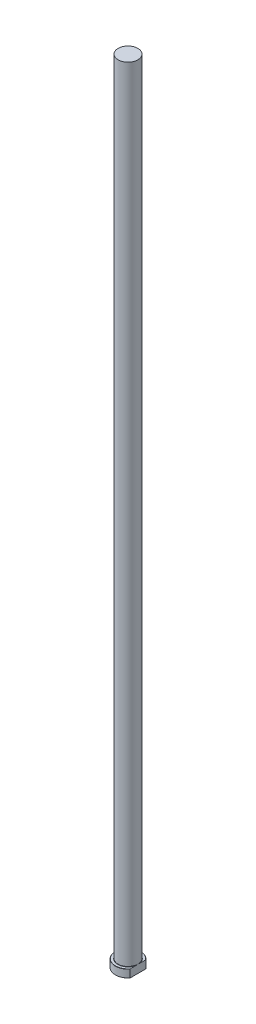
ISO-10303-21;
HEADER;
FILE_DESCRIPTION(('STEP AP214'),'2;1');
FILE_NAME('part.step','',(''),(''),'','','');
FILE_SCHEMA(('AUTOMOTIVE_DESIGN { 1 0 10303 214 1 1 1 1 }'));
ENDSEC;
DATA;
#1=APPLICATION_CONTEXT('core data for automotive mechanical design processes');
#2=APPLICATION_PROTOCOL_DEFINITION('international standard','automotive_design',2000,#1);
#3=PRODUCT_CONTEXT('',#1,'mechanical');
#4=PRODUCT('Part','Part','',(#3));
#5=PRODUCT_RELATED_PRODUCT_CATEGORY('part','',(#4));
#6=PRODUCT_DEFINITION_FORMATION('','',#4);
#7=PRODUCT_DEFINITION_CONTEXT('part definition',#1,'design');
#8=PRODUCT_DEFINITION('design','',#6,#7);
#9=PRODUCT_DEFINITION_SHAPE('','',#8);
#10=(LENGTH_UNIT() NAMED_UNIT(*) SI_UNIT(.MILLI.,.METRE.));
#11=(NAMED_UNIT(*) PLANE_ANGLE_UNIT() SI_UNIT($,.RADIAN.));
#12=(NAMED_UNIT(*) SI_UNIT($,.STERADIAN.) SOLID_ANGLE_UNIT());
#13=UNCERTAINTY_MEASURE_WITH_UNIT(LENGTH_MEASURE(1.E-05),#10,'distance_accuracy_value','');
#14=(GEOMETRIC_REPRESENTATION_CONTEXT(3) GLOBAL_UNCERTAINTY_ASSIGNED_CONTEXT((#13)) GLOBAL_UNIT_ASSIGNED_CONTEXT((#10,
#11,#12)) REPRESENTATION_CONTEXT('',''));
#15=CARTESIAN_POINT('',(0.,0.,0.));
#16=DIRECTION('',(0.,0.,1.));
#17=DIRECTION('',(1.,0.,0.));
#18=AXIS2_PLACEMENT_3D('',#15,#16,#17);
#19=CARTESIAN_POINT('',(0.,0.,0.));
#20=DIRECTION('',(0.,-1.,0.));
#21=DIRECTION('',(0.,0.,-1.));
#22=AXIS2_PLACEMENT_3D('',#19,#20,#21);
#23=PLANE('',#22);
#24=CARTESIAN_POINT('',(0.,0.,0.));
#25=DIRECTION('',(0.,-1.,0.));
#26=DIRECTION('',(0.,0.,-1.));
#27=AXIS2_PLACEMENT_3D('',#24,#25,#26);
#28=CIRCLE('',#27,15.7999999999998);
#29=CARTESIAN_POINT('',(12.5,0.,9.66385016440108));
#30=VERTEX_POINT('',#29);
#31=CARTESIAN_POINT('',(12.5,0.,-9.66385016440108));
#32=VERTEX_POINT('',#31);
#33=EDGE_CURVE('E98',#30,#32,#28,.T.);
#34=ORIENTED_EDGE('',*,*,#33,.T.);
#35=DIRECTION('',(0.,0.,1.));
#36=VECTOR('',#35,1.);
#37=CARTESIAN_POINT('',(12.5,0.,-9.98749217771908));
#38=LINE('',#37,#36);
#39=EDGE_CURVE('E83',#32,#30,#38,.T.);
#40=ORIENTED_EDGE('',*,*,#39,.T.);
#41=EDGE_LOOP('',(#34,#40));
#42=FACE_BOUND('',#41,.T.);
#43=ADVANCED_FACE('F32',(#42),#23,.T.);
#44=CARTESIAN_POINT('',(0.,259.958771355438,0.));
#45=DIRECTION('',(0.,1.,0.));
#46=DIRECTION('',(0.,0.,1.));
#47=AXIS2_PLACEMENT_3D('',#44,#45,#46);
#48=CYLINDRICAL_SURFACE('',#47,16.);
#49=CARTESIAN_POINT('',(0.,9.80000000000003,0.));
#50=DIRECTION('',(0.,1.,0.));
#51=DIRECTION('',(0.,0.,1.));
#52=AXIS2_PLACEMENT_3D('',#49,#50,#51);
#53=CIRCLE('',#52,16.);
#54=CARTESIAN_POINT('',(12.5,9.80000000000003,9.98749217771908));
#55=VERTEX_POINT('',#54);
#56=CARTESIAN_POINT('',(12.5,9.80000000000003,-9.98749217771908));
#57=VERTEX_POINT('',#56);
#58=EDGE_CURVE('E104',#55,#57,#53,.F.);
#59=ORIENTED_EDGE('',*,*,#58,.T.);
#60=DIRECTION('',(0.,-1.,0.));
#61=VECTOR('',#60,1.);
#62=CARTESIAN_POINT('',(12.5,1000.,-9.98749217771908));
#63=LINE('',#62,#61);
#64=CARTESIAN_POINT('',(12.5,0.2000000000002,-9.98749217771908));
#65=VERTEX_POINT('',#64);
#66=EDGE_CURVE('E183',#57,#65,#63,.T.);
#67=ORIENTED_EDGE('',*,*,#66,.T.);
#68=CARTESIAN_POINT('',(0.,0.2000000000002,0.));
#69=DIRECTION('',(0.,-1.,0.));
#70=DIRECTION('',(0.,0.,-1.));
#71=AXIS2_PLACEMENT_3D('',#68,#69,#70);
#72=CIRCLE('',#71,16.);
#73=CARTESIAN_POINT('',(12.5,0.2000000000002,9.98749217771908));
#74=VERTEX_POINT('',#73);
#75=EDGE_CURVE('E100',#65,#74,#72,.F.);
#76=ORIENTED_EDGE('',*,*,#75,.T.);
#77=DIRECTION('',(0.,-1.,0.));
#78=VECTOR('',#77,1.);
#79=CARTESIAN_POINT('',(12.5,1000.,9.98749217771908));
#80=LINE('',#79,#78);
#81=EDGE_CURVE('E93',#55,#74,#80,.T.);
#82=ORIENTED_EDGE('',*,*,#81,.F.);
#83=EDGE_LOOP('',(#59,#67,#76,#82));
#84=FACE_BOUND('',#83,.T.);
#85=ADVANCED_FACE('F158',(#84),#48,.T.);
#86=CARTESIAN_POINT('',(-16.,10.,0.));
#87=DIRECTION('',(0.,1.,0.));
#88=DIRECTION('',(0.,0.,1.));
#89=AXIS2_PLACEMENT_3D('',#86,#87,#88);
#90=PLANE('',#89);
#91=CARTESIAN_POINT('',(0.,10.,0.));
#92=DIRECTION('',(0.,1.,0.));
#93=DIRECTION('',(0.,0.,1.));
#94=AXIS2_PLACEMENT_3D('',#91,#92,#93);
#95=CIRCLE('',#94,15.8);
#96=CARTESIAN_POINT('',(12.5,10.,-9.66385016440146));
#97=VERTEX_POINT('',#96);
#98=CARTESIAN_POINT('',(12.5,10.,9.66385016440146));
#99=VERTEX_POINT('',#98);
#100=EDGE_CURVE('E178',#97,#99,#95,.T.);
#101=ORIENTED_EDGE('',*,*,#100,.T.);
#102=DIRECTION('',(0.,0.,-1.));
#103=VECTOR('',#102,1.);
#104=CARTESIAN_POINT('',(12.5,10.,0.));
#105=LINE('',#104,#103);
#106=CARTESIAN_POINT('',(12.5,10.,2.75499546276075));
#107=VERTEX_POINT('',#106);
#108=EDGE_CURVE('E57',#99,#107,#105,.T.);
#109=ORIENTED_EDGE('',*,*,#108,.T.);
#110=CARTESIAN_POINT('',(0.,10.,0.));
#111=DIRECTION('',(0.,1.,0.));
#112=DIRECTION('',(0.,0.,1.));
#113=AXIS2_PLACEMENT_3D('',#110,#111,#112);
#114=CIRCLE('',#113,12.8);
#115=CARTESIAN_POINT('',(12.5,10.,-2.75499546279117));
#116=VERTEX_POINT('',#115);
#117=EDGE_CURVE('E107',#107,#116,#114,.F.);
#118=ORIENTED_EDGE('',*,*,#117,.T.);
#119=EDGE_CURVE('E136',#116,#97,#105,.T.);
#120=ORIENTED_EDGE('',*,*,#119,.T.);
#121=EDGE_LOOP('',(#101,#109,#118,#120));
#122=FACE_BOUND('',#121,.T.);
#123=ADVANCED_FACE('F147',(#122),#90,.T.);
#124=CARTESIAN_POINT('',(0.,10.,0.));
#125=DIRECTION('',(0.,-1.,0.));
#126=DIRECTION('',(0.,0.,-1.));
#127=AXIS2_PLACEMENT_3D('',#124,#125,#126);
#128=CONICAL_SURFACE('',#127,15.8,0.785398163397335);
#129=ORIENTED_EDGE('',*,*,#58,.F.);
#130=CARTESIAN_POINT('',(12.5,0.520063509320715,21.9732835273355));
#131=CARTESIAN_POINT('',(12.5,0.802025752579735,21.6488770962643));
#132=CARTESIAN_POINT('',(12.5,1.0831321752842,21.3237240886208));
#133=CARTESIAN_POINT('',(12.5,1.64338244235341,20.6717229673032));
#134=CARTESIAN_POINT('',(12.5,1.92252625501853,20.344874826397));
#135=CARTESIAN_POINT('',(12.5,2.47872061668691,19.6891394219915));
#136=CARTESIAN_POINT('',(12.5,2.75577013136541,19.3602512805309));
#137=CARTESIAN_POINT('',(12.5,3.30732757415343,18.7003513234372));
#138=CARTESIAN_POINT('',(12.5,3.58183551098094,18.3693395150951));
#139=CARTESIAN_POINT('',(12.5,4.1340462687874,17.6974852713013));
#140=CARTESIAN_POINT('',(12.5,4.41168315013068,17.3565885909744));
#141=CARTESIAN_POINT('',(12.5,4.96342557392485,16.671950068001));
#142=CARTESIAN_POINT('',(12.5,5.23753113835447,16.3282082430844));
#143=CARTESIAN_POINT('',(12.5,5.78155974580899,15.6375575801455));
#144=CARTESIAN_POINT('',(12.5,6.05148375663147,15.2906495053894));
#145=CARTESIAN_POINT('',(12.5,6.58649101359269,14.5931154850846));
#146=CARTESIAN_POINT('',(12.5,6.85157426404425,14.2424895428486));
#147=CARTESIAN_POINT('',(12.5,7.37633965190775,13.5365100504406));
#148=CARTESIAN_POINT('',(12.5,7.63601439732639,13.1811509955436));
#149=CARTESIAN_POINT('',(12.5,8.14848411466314,12.4654890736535));
#150=CARTESIAN_POINT('',(12.5,8.401279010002,12.1051861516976));
#151=CARTESIAN_POINT('',(12.5,8.8987726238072,11.3785626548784));
#152=CARTESIAN_POINT('',(12.5,9.14346420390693,11.0122371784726));
#153=CARTESIAN_POINT('',(12.5,9.62269650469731,10.2729925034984));
#154=CARTESIAN_POINT('',(12.5,9.85723744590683,9.90007344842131));
#155=CARTESIAN_POINT('',(12.5,10.3121733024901,9.14938704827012));
#156=CARTESIAN_POINT('',(12.5,10.5326589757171,8.77167495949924));
#157=CARTESIAN_POINT('',(12.5,10.9584323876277,8.00766886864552));
#158=CARTESIAN_POINT('',(12.5,11.1637182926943,7.62137383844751));
#159=CARTESIAN_POINT('',(12.5,11.5550521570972,6.83979556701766));
#160=CARTESIAN_POINT('',(12.5,11.7411279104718,6.4445263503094));
#161=CARTESIAN_POINT('',(12.5,12.0896891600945,5.64379531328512));
#162=CARTESIAN_POINT('',(12.5,12.2521837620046,5.23833749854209));
#163=CARTESIAN_POINT('',(12.5,12.5515074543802,4.40750298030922));
#164=CARTESIAN_POINT('',(12.5,12.6876692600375,3.9818830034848));
#165=CARTESIAN_POINT('',(12.5,12.9230664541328,3.12036018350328));
#166=CARTESIAN_POINT('',(12.5,13.0223077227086,2.68445898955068));
#167=CARTESIAN_POINT('',(12.5,13.1386499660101,2.0263717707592));
#168=CARTESIAN_POINT('',(12.5,13.1719581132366,1.80697979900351));
#169=CARTESIAN_POINT('',(12.5,13.2273896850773,1.36679892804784));
#170=CARTESIAN_POINT('',(12.5,13.2495147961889,1.14601024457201));
#171=CARTESIAN_POINT('',(12.5,13.2821590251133,0.703578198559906));
#172=CARTESIAN_POINT('',(12.5,13.2926782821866,0.48193484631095));
#173=CARTESIAN_POINT('',(12.5,13.3019073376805,0.0383999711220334));
#174=CARTESIAN_POINT('',(12.5,13.3006171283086,-0.18349155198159));
#175=CARTESIAN_POINT('',(12.5,13.2862386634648,-0.627300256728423));
#176=CARTESIAN_POINT('',(12.5,13.2731286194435,-0.849216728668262));
#177=CARTESIAN_POINT('',(12.5,13.2353379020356,-1.29205679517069));
#178=CARTESIAN_POINT('',(12.5,13.2106571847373,-1.512980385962));
#179=CARTESIAN_POINT('',(12.5,13.1501829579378,-1.95331306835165));
#180=CARTESIAN_POINT('',(12.5,13.1143886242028,-2.1727220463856));
#181=CARTESIAN_POINT('',(12.5,13.0323124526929,-2.60958138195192));
#182=CARTESIAN_POINT('',(12.5,12.9860290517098,-2.82703144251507));
#183=CARTESIAN_POINT('',(12.5,12.8318007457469,-3.47896053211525));
#184=CARTESIAN_POINT('',(12.5,12.708914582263,-3.90995974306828));
#185=CARTESIAN_POINT('',(12.5,12.4301044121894,-4.76088311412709));
#186=CARTESIAN_POINT('',(12.5,12.2741797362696,-5.18080704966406));
#187=CARTESIAN_POINT('',(12.5,11.8998555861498,-6.09704545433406));
#188=CARTESIAN_POINT('',(12.5,11.6752155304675,-6.59079268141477));
#189=CARTESIAN_POINT('',(12.5,11.1959254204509,-7.56361802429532));
#190=CARTESIAN_POINT('',(12.5,10.9412581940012,-8.04268754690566));
#191=CARTESIAN_POINT('',(12.5,10.4085643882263,-8.98884891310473));
#192=CARTESIAN_POINT('',(12.5,10.130490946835,-9.45591416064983));
#193=CARTESIAN_POINT('',(12.5,9.5567955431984,-10.3789360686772));
#194=CARTESIAN_POINT('',(12.5,9.26117703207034,-10.8348948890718));
#195=CARTESIAN_POINT('',(12.5,8.65460060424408,-11.7400212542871));
#196=CARTESIAN_POINT('',(12.5,8.34356847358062,-12.1891388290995));
#197=CARTESIAN_POINT('',(12.5,7.71056360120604,-13.079591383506));
#198=CARTESIAN_POINT('',(12.5,7.38859046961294,-13.5209260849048));
#199=CARTESIAN_POINT('',(12.5,6.73627073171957,-14.3965599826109));
#200=CARTESIAN_POINT('',(12.5,6.40593412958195,-14.8308666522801));
#201=CARTESIAN_POINT('',(12.5,5.73818513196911,-15.6939842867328));
#202=CARTESIAN_POINT('',(12.5,5.40077283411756,-16.1227953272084));
#203=CARTESIAN_POINT('',(12.5,4.69065889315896,-17.0127103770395));
#204=CARTESIAN_POINT('',(12.5,4.31743190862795,-17.473394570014));
#205=CARTESIAN_POINT('',(12.5,3.56536441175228,-18.3901509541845));
#206=CARTESIAN_POINT('',(12.5,3.18652389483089,-18.8462231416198));
#207=CARTESIAN_POINT('',(12.5,2.42850462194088,-19.7493414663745));
#208=CARTESIAN_POINT('',(12.5,2.04937794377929,-20.196431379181));
#209=CARTESIAN_POINT('',(12.5,1.28737664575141,-21.087231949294));
#210=CARTESIAN_POINT('',(12.5,0.904502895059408,-21.5309433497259));
#211=CARTESIAN_POINT('',(12.5,0.520063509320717,-21.9732835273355));
#212=B_SPLINE_CURVE_WITH_KNOTS('',3,(#130,#131,#132,#133,#134,#135,#136,#137,#138,#139,#140,
#141,#142,#143,#144,#145,#146,#147,#148,#149,#150,#151,#152,#153,#154,#155,#156,#157,#158,#159,
#160,#161,#162,#163,#164,#165,#166,#167,#168,#169,#170,#171,#172,#173,#174,#175,#176,#177,#178,
#179,#180,#181,#182,#183,#184,#185,#186,#187,#188,#189,#190,#191,#192,#193,#194,#195,#196,#197,
#198,#199,#200,#201,#202,#203,#204,#205,#206,#207,#208,#209,#210,#211),.UNSPECIFIED.,.F.,.F.,(4,
2,2,2,2,2,2,2,2,2,2,2,2,2,2,2,2,2,2,2,2,2,2,2,2,2,2,2,2,2,2,2,2,2,2,2,2,2,2,2,4),(0.,
1.28945110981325,2.57892299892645,3.8689948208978,5.15906221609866,6.47799420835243,
7.79691798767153,9.11553180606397,10.4341444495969,11.7544545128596,13.0747792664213,
14.396237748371,15.7176675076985,17.0294519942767,18.3413944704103,19.6514113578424,
20.9609210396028,22.3001940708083,23.6392537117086,24.3047314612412,24.9701088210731,
25.6354781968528,26.3008480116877,26.9674468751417,27.63404826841,28.300699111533,
28.9674493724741,30.3101828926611,31.6529436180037,33.2788964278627,34.9057836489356,
36.5360093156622,38.1659153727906,39.8046231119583,41.4433893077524,43.0802801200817,
44.717148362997,46.4957886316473,48.2744303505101,50.0329971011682,51.7911651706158),.UNSPECIFIED.);
#213=EDGE_CURVE('E135',#55,#99,#212,.T.);
#214=ORIENTED_EDGE('',*,*,#213,.T.);
#215=ORIENTED_EDGE('',*,*,#100,.F.);
#216=EDGE_CURVE('E127',#97,#57,#212,.T.);
#217=ORIENTED_EDGE('',*,*,#216,.T.);
#218=EDGE_LOOP('',(#129,#214,#215,#217));
#219=FACE_BOUND('',#218,.T.);
#220=ADVANCED_FACE('F143',(#219),#128,.T.);
#221=CARTESIAN_POINT('',(0.,0.2000000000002,0.));
#222=DIRECTION('',(0.,1.,0.));
#223=DIRECTION('',(0.,0.,1.));
#224=AXIS2_PLACEMENT_3D('',#221,#222,#223);
#225=CONICAL_SURFACE('',#224,16.,0.785398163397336);
#226=ORIENTED_EDGE('',*,*,#75,.F.);
#227=CARTESIAN_POINT('',(12.5,9.47993649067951,-21.9732835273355));
#228=CARTESIAN_POINT('',(12.5,9.19797424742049,-21.6488770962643));
#229=CARTESIAN_POINT('',(12.5,8.91686782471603,-21.3237240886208));
#230=CARTESIAN_POINT('',(12.5,8.35661755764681,-20.6717229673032));
#231=CARTESIAN_POINT('',(12.5,8.0774737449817,-20.344874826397));
#232=CARTESIAN_POINT('',(12.5,7.52127938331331,-19.6891394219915));
#233=CARTESIAN_POINT('',(12.5,7.24422986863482,-19.3602512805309));
#234=CARTESIAN_POINT('',(12.5,6.69267242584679,-18.7003513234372));
#235=CARTESIAN_POINT('',(12.5,6.41816448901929,-18.3693395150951));
#236=CARTESIAN_POINT('',(12.5,5.86595373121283,-17.6974852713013));
#237=CARTESIAN_POINT('',(12.5,5.58831684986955,-17.3565885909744));
#238=CARTESIAN_POINT('',(12.5,5.03657442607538,-16.671950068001));
#239=CARTESIAN_POINT('',(12.5,4.76246886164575,-16.3282082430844));
#240=CARTESIAN_POINT('',(12.5,4.21844025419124,-15.6375575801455));
#241=CARTESIAN_POINT('',(12.5,3.94851624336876,-15.2906495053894));
#242=CARTESIAN_POINT('',(12.5,3.41350898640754,-14.5931154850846));
#243=CARTESIAN_POINT('',(12.5,3.14842573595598,-14.2424895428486));
#244=CARTESIAN_POINT('',(12.5,2.62366034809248,-13.5365100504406));
#245=CARTESIAN_POINT('',(12.5,2.36398560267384,-13.1811509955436));
#246=CARTESIAN_POINT('',(12.5,1.85151588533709,-12.4654890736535));
#247=CARTESIAN_POINT('',(12.5,1.59872098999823,-12.1051861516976));
#248=CARTESIAN_POINT('',(12.5,1.10122737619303,-11.3785626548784));
#249=CARTESIAN_POINT('',(12.5,0.856535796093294,-11.0122371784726));
#250=CARTESIAN_POINT('',(12.5,0.377303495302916,-10.2729925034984));
#251=CARTESIAN_POINT('',(12.5,0.142762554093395,-9.90007344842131));
#252=CARTESIAN_POINT('',(12.5,-0.31217330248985,-9.14938704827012));
#253=CARTESIAN_POINT('',(12.5,-0.532658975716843,-8.77167495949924));
#254=CARTESIAN_POINT('',(12.5,-0.95843238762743,-8.00766886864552));
#255=CARTESIAN_POINT('',(12.5,-1.16371829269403,-7.62137383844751));
#256=CARTESIAN_POINT('',(12.5,-1.55505215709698,-6.83979556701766));
#257=CARTESIAN_POINT('',(12.5,-1.74112791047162,-6.4445263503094));
#258=CARTESIAN_POINT('',(12.5,-2.08968916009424,-5.64379531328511));
#259=CARTESIAN_POINT('',(12.5,-2.25218376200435,-5.23833749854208));
#260=CARTESIAN_POINT('',(12.5,-2.55150745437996,-4.40750298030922));
#261=CARTESIAN_POINT('',(12.5,-2.68766926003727,-3.98188300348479));
#262=CARTESIAN_POINT('',(12.5,-2.92306645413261,-3.12036018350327));
#263=CARTESIAN_POINT('',(12.5,-3.02230772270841,-2.68445898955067));
#264=CARTESIAN_POINT('',(12.5,-3.13864996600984,-2.02637177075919));
#265=CARTESIAN_POINT('',(12.5,-3.1719581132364,-1.8069797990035));
#266=CARTESIAN_POINT('',(12.5,-3.22738968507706,-1.36679892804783));
#267=CARTESIAN_POINT('',(12.5,-3.24951479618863,-1.146010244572));
#268=CARTESIAN_POINT('',(12.5,-3.28215902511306,-0.703578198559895));
#269=CARTESIAN_POINT('',(12.5,-3.29267828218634,-0.481934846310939));
#270=CARTESIAN_POINT('',(12.5,-3.30190733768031,-0.0383999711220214));
#271=CARTESIAN_POINT('',(12.5,-3.30061712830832,0.183491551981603));
#272=CARTESIAN_POINT('',(12.5,-3.28623866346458,0.627300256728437));
#273=CARTESIAN_POINT('',(12.5,-3.27312861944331,0.849216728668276));
#274=CARTESIAN_POINT('',(12.5,-3.23533790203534,1.2920567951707));
#275=CARTESIAN_POINT('',(12.5,-3.21065718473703,1.51298038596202));
#276=CARTESIAN_POINT('',(12.5,-3.15018295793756,1.95331306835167));
#277=CARTESIAN_POINT('',(12.5,-3.11438862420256,2.17272204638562));
#278=CARTESIAN_POINT('',(12.5,-3.03231245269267,2.60958138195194));
#279=CARTESIAN_POINT('',(12.5,-2.98602905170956,2.82703144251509));
#280=CARTESIAN_POINT('',(12.5,-2.83180074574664,3.47896053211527));
#281=CARTESIAN_POINT('',(12.5,-2.70891458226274,3.9099597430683));
#282=CARTESIAN_POINT('',(12.5,-2.43010441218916,4.76088311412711));
#283=CARTESIAN_POINT('',(12.5,-2.27417973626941,5.18080704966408));
#284=CARTESIAN_POINT('',(12.5,-1.89985558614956,6.09704545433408));
#285=CARTESIAN_POINT('',(12.5,-1.67521553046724,6.5907926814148));
#286=CARTESIAN_POINT('',(12.5,-1.19592542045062,7.56361802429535));
#287=CARTESIAN_POINT('',(12.5,-0.941258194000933,8.04268754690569));
#288=CARTESIAN_POINT('',(12.5,-0.408564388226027,8.98884891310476));
#289=CARTESIAN_POINT('',(12.5,-0.130490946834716,9.45591416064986));
#290=CARTESIAN_POINT('',(12.5,0.443204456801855,10.3789360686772));
#291=CARTESIAN_POINT('',(12.5,0.738822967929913,10.8348948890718));
#292=CARTESIAN_POINT('',(12.5,1.34539939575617,11.7400212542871));
#293=CARTESIAN_POINT('',(12.5,1.65643152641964,12.1891388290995));
#294=CARTESIAN_POINT('',(12.5,2.28943639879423,13.0795913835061));
#295=CARTESIAN_POINT('',(12.5,2.61140953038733,13.5209260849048));
#296=CARTESIAN_POINT('',(12.5,3.26372926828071,14.396559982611));
#297=CARTESIAN_POINT('',(12.5,3.59406587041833,14.8308666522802));
#298=CARTESIAN_POINT('',(12.5,4.26181486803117,15.6939842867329));
#299=CARTESIAN_POINT('',(12.5,4.59922716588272,16.1227953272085));
#300=CARTESIAN_POINT('',(12.5,5.30934110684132,17.0127103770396));
#301=CARTESIAN_POINT('',(12.5,5.68256809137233,17.473394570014));
#302=CARTESIAN_POINT('',(12.5,6.43463558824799,18.3901509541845));
#303=CARTESIAN_POINT('',(12.5,6.81347610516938,18.8462231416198));
#304=CARTESIAN_POINT('',(12.5,7.57149537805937,19.7493414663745));
#305=CARTESIAN_POINT('',(12.5,7.95062205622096,20.1964313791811));
#306=CARTESIAN_POINT('',(12.5,8.71262335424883,21.087231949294));
#307=CARTESIAN_POINT('',(12.5,9.09549710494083,21.5309433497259));
#308=CARTESIAN_POINT('',(12.5,9.47993649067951,21.9732835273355));
#309=B_SPLINE_CURVE_WITH_KNOTS('',3,(#227,#228,#229,#230,#231,#232,#233,#234,#235,#236,#237,
#238,#239,#240,#241,#242,#243,#244,#245,#246,#247,#248,#249,#250,#251,#252,#253,#254,#255,#256,
#257,#258,#259,#260,#261,#262,#263,#264,#265,#266,#267,#268,#269,#270,#271,#272,#273,#274,#275,
#276,#277,#278,#279,#280,#281,#282,#283,#284,#285,#286,#287,#288,#289,#290,#291,#292,#293,#294,
#295,#296,#297,#298,#299,#300,#301,#302,#303,#304,#305,#306,#307,#308),.UNSPECIFIED.,.F.,.F.,(4,
2,2,2,2,2,2,2,2,2,2,2,2,2,2,2,2,2,2,2,2,2,2,2,2,2,2,2,2,2,2,2,2,2,2,2,2,2,2,2,4),(0.,
1.28945110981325,2.57892299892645,3.86899482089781,5.15906221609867,6.47799420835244,
7.79691798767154,9.11553180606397,10.4341444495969,11.7544545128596,13.0747792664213,
14.3962377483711,15.7176675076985,17.0294519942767,18.3413944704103,19.6514113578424,
20.9609210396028,22.3001940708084,23.6392537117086,24.3047314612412,24.9701088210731,
25.6354781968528,26.3008480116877,26.9674468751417,27.6340482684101,28.300699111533,
28.9674493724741,30.3101828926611,31.6529436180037,33.2788964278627,34.9057836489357,
36.5360093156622,38.1659153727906,39.8046231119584,41.4433893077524,43.0802801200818,
44.7171483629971,46.4957886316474,48.2744303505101,50.0329971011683,51.7911651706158),.UNSPECIFIED.);
#310=EDGE_CURVE('E86',#65,#32,#309,.T.);
#311=ORIENTED_EDGE('',*,*,#310,.T.);
#312=ORIENTED_EDGE('',*,*,#33,.F.);
#313=EDGE_CURVE('E89',#30,#74,#309,.T.);
#314=ORIENTED_EDGE('',*,*,#313,.T.);
#315=EDGE_LOOP('',(#226,#311,#312,#314));
#316=FACE_BOUND('',#315,.T.);
#317=ADVANCED_FACE('F97',(#316),#225,.T.);
#318=CARTESIAN_POINT('',(0.,10.3,0.));
#319=DIRECTION('',(0.,1.,0.));
#320=DIRECTION('',(0.,0.,1.));
#321=AXIS2_PLACEMENT_3D('',#318,#319,#320);
#322=TOROIDAL_SURFACE('',#321,12.8,0.3);
#323=CARTESIAN_POINT('',(12.5,10.3,0.));
#324=CARTESIAN_POINT('',(12.5,10.300000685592,-6.08820746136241E-09));
#325=CARTESIAN_POINT('',(12.5,10.300001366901,-5.08876655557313E-07));
#326=CARTESIAN_POINT('',(12.5,10.3000026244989,-1.73661802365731E-06));
#327=CARTESIAN_POINT('',(12.5,10.3000031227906,-2.48490474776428E-06));
#328=CARTESIAN_POINT('',(12.5,10.3000042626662,-4.35291163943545E-06));
#329=CARTESIAN_POINT('',(12.5,10.3000048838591,-5.50325566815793E-06));
#330=CARTESIAN_POINT('',(12.5,10.3000058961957,-7.76527023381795E-06));
#331=CARTESIAN_POINT('',(12.5,10.3000063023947,-8.87193032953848E-06));
#332=CARTESIAN_POINT('',(12.5,10.3000080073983,-1.35535117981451E-05));
#333=CARTESIAN_POINT('',(12.5,10.300009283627,-1.71478698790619E-05));
#334=CARTESIAN_POINT('',(12.5,10.3000111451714,-2.39305737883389E-05));
#335=CARTESIAN_POINT('',(12.5,10.30001180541,-2.70989461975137E-05));
#336=CARTESIAN_POINT('',(12.5,10.3000165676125,-5.05411717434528E-05));
#337=CARTESIAN_POINT('',(12.5,10.3000200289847,-7.09185071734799E-05));
#338=CARTESIAN_POINT('',(12.5,10.300032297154,-0.000151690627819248));
#339=CARTESIAN_POINT('',(12.5,10.3000383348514,-0.000212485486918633));
#340=CARTESIAN_POINT('',(12.5,10.3000659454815,-0.000448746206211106));
#341=CARTESIAN_POINT('',(12.5,10.3000952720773,-0.000623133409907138));
#342=CARTESIAN_POINT('',(12.5,10.3002039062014,-0.00128772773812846));
#343=CARTESIAN_POINT('',(12.5,10.3002776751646,-0.00177866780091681));
#344=CARTESIAN_POINT('',(12.5,10.3005641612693,-0.00366503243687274));
#345=CARTESIAN_POINT('',(12.5,10.3007823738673,-0.00505974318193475));
#346=CARTESIAN_POINT('',(12.5,10.3018133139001,-0.0116680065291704));
#347=CARTESIAN_POINT('',(12.5,10.3026180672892,-0.0168825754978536));
#348=CARTESIAN_POINT('',(12.5,10.3120514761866,-0.0779781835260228));
#349=CARTESIAN_POINT('',(12.5,10.3207244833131,-0.133853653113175));
#350=CARTESIAN_POINT('',(12.5,10.3388658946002,-0.251282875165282));
#351=CARTESIAN_POINT('',(12.5,10.3483257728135,-0.312837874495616));
#352=CARTESIAN_POINT('',(12.5,10.3639287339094,-0.415046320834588));
#353=CARTESIAN_POINT('',(12.5,10.3701065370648,-0.455694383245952));
#354=CARTESIAN_POINT('',(12.5,10.3822268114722,-0.53596333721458));
#355=CARTESIAN_POINT('',(12.5,10.3881712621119,-0.57558393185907));
#356=CARTESIAN_POINT('',(12.5,10.4217048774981,-0.800849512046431));
#357=CARTESIAN_POINT('',(12.5,10.4483430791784,-0.986638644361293));
#358=CARTESIAN_POINT('',(12.5,10.4978676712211,-1.36073085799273));
#359=CARTESIAN_POINT('',(12.5,10.5207116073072,-1.54903981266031));
#360=CARTESIAN_POINT('',(12.5,10.5510813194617,-1.84372746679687));
#361=CARTESIAN_POINT('',(12.5,10.5609338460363,-1.94986334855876));
#362=CARTESIAN_POINT('',(12.5,10.5778401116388,-2.16235517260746));
#363=CARTESIAN_POINT('',(12.5,10.5848941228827,-2.26871109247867));
#364=CARTESIAN_POINT('',(12.5,10.5953321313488,-2.48120575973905));
#365=CARTESIAN_POINT('',(12.5,10.5987299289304,-2.58734380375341));
#366=CARTESIAN_POINT('',(12.5,10.6006981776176,-2.79965289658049));
#367=CARTESIAN_POINT('',(12.5,10.5992708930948,-2.90582390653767));
#368=CARTESIAN_POINT('',(12.5,10.5920660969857,-3.06242328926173));
#369=CARTESIAN_POINT('',(12.5,10.5889531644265,-3.11297361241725));
#370=CARTESIAN_POINT('',(12.5,10.5807735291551,-3.21396863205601));
#371=CARTESIAN_POINT('',(12.5,10.5757051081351,-3.26441319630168));
#372=CARTESIAN_POINT('',(12.5,10.5631618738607,-3.36425835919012));
#373=CARTESIAN_POINT('',(12.5,10.555723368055,-3.41366343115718));
#374=CARTESIAN_POINT('',(12.5,10.5375916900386,-3.51185380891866));
#375=CARTESIAN_POINT('',(12.5,10.5269024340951,-3.56063978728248));
#376=CARTESIAN_POINT('',(12.5,10.5054348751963,-3.6391830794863));
#377=CARTESIAN_POINT('',(12.5,10.4961365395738,-3.66933696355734));
#378=CARTESIAN_POINT('',(12.5,10.474763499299,-3.72862196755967));
#379=CARTESIAN_POINT('',(12.5,10.462694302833,-3.75775498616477));
#380=CARTESIAN_POINT('',(12.5,10.4380385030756,-3.80618627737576));
#381=CARTESIAN_POINT('',(12.5,10.4265070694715,-3.8259857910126));
#382=CARTESIAN_POINT('',(12.5,10.4063926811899,-3.85382979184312));
#383=CARTESIAN_POINT('',(12.5,10.3991733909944,-3.8628437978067));
#384=CARTESIAN_POINT('',(12.5,10.3835233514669,-3.87975615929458));
#385=CARTESIAN_POINT('',(12.5,10.3750969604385,-3.88765833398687));
#386=CARTESIAN_POINT('',(12.5,10.3611065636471,-3.89824999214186));
#387=CARTESIAN_POINT('',(12.5,10.3560749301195,-3.9016366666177));
#388=CARTESIAN_POINT('',(12.5,10.3455861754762,-3.90768435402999));
#389=CARTESIAN_POINT('',(12.5,10.3401292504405,-3.91034569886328));
#390=CARTESIAN_POINT('',(12.5,10.3287657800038,-3.91474619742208));
#391=CARTESIAN_POINT('',(12.5,10.3228544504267,-3.91647335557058));
#392=CARTESIAN_POINT('',(12.5,10.3108092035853,-3.91873417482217));
#393=CARTESIAN_POINT('',(12.5,10.3046756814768,-3.91926985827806));
#394=CARTESIAN_POINT('',(12.5,10.293185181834,-3.91908606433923));
#395=CARTESIAN_POINT('',(12.5,10.2878253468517,-3.91851265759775));
#396=CARTESIAN_POINT('',(12.5,10.2772818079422,-3.91645967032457));
#397=CARTESIAN_POINT('',(12.5,10.2720982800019,-3.91497921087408));
#398=CARTESIAN_POINT('',(12.5,10.2604757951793,-3.91068184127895));
#399=CARTESIAN_POINT('',(12.5,10.2541380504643,-3.90759459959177));
#400=CARTESIAN_POINT('',(12.5,10.2420308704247,-3.90046137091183));
#401=CARTESIAN_POINT('',(12.5,10.2362627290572,-3.89641326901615));
#402=CARTESIAN_POINT('',(12.5,10.2213149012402,-3.88449159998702));
#403=CARTESIAN_POINT('',(12.5,10.2126659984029,-3.87596096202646));
#404=CARTESIAN_POINT('',(12.5,10.1966439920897,-3.85778795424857));
#405=CARTESIAN_POINT('',(12.5,10.1892747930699,-3.84814232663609));
#406=CARTESIAN_POINT('',(12.5,10.1725709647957,-3.82389784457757));
#407=CARTESIAN_POINT('',(12.5,10.1637497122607,-3.80894948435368));
#408=CARTESIAN_POINT('',(12.5,10.1475318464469,-3.77828784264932));
#409=CARTESIAN_POINT('',(12.5,10.1401383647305,-3.76257297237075));
#410=CARTESIAN_POINT('',(12.5,10.1264047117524,-3.73059893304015));
#411=CARTESIAN_POINT('',(12.5,10.1200701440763,-3.71433738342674));
#412=CARTESIAN_POINT('',(12.5,10.1082745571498,-3.68152468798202));
#413=CARTESIAN_POINT('',(12.5,10.1028126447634,-3.66497385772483));
#414=CARTESIAN_POINT('',(12.5,10.0886990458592,-3.61898372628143));
#415=CARTESIAN_POINT('',(12.5,10.0807822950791,-3.58931942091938));
#416=CARTESIAN_POINT('',(12.5,10.0665587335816,-3.52960268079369));
#417=CARTESIAN_POINT('',(12.5,10.0602528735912,-3.49955002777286));
#418=CARTESIAN_POINT('',(12.5,10.0432020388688,-3.40892020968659));
#419=CARTESIAN_POINT('',(12.5,10.0343558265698,-3.34798718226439));
#420=CARTESIAN_POINT('',(12.5,10.0201228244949,-3.22565891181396));
#421=CARTESIAN_POINT('',(12.5,10.0147414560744,-3.16426309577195));
#422=CARTESIAN_POINT('',(12.5,10.0066240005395,-3.04138251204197));
#423=CARTESIAN_POINT('',(12.5,10.0038844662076,-2.97989796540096));
#424=CARTESIAN_POINT('',(12.5,10.0005131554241,-2.8577235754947));
#425=CARTESIAN_POINT('',(12.5,9.99985290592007,-2.79703443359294));
#426=CARTESIAN_POINT('',(12.5,10.0002004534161,-2.67565900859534));
#427=CARTESIAN_POINT('',(12.5,10.0012083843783,-2.61497272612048));
#428=CARTESIAN_POINT('',(12.5,10.0063170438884,-2.43292800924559));
#429=CARTESIAN_POINT('',(12.5,10.0125034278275,-2.31162822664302));
#430=CARTESIAN_POINT('',(12.5,10.028923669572,-2.06913309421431));
#431=CARTESIAN_POINT('',(12.5,10.0391638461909,-1.94793820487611));
#432=CARTESIAN_POINT('',(12.5,10.0626694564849,-1.70583328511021));
#433=CARTESIAN_POINT('',(12.5,10.0759352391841,-1.58492328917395));
#434=CARTESIAN_POINT('',(12.5,10.1189883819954,-1.22310927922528));
#435=CARTESIAN_POINT('',(12.5,10.1520738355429,-0.982605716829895));
#436=CARTESIAN_POINT('',(12.5,10.2222679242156,-0.502161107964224));
#437=CARTESIAN_POINT('',(12.5,10.2593775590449,-0.262220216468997));
#438=CARTESIAN_POINT('',(12.5,10.2965571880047,-0.0222236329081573));
#439=CARTESIAN_POINT('',(12.5,10.2965669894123,-0.0221603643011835));
#440=CARTESIAN_POINT('',(12.5,10.2972687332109,-0.017630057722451));
#441=CARTESIAN_POINT('',(12.5,10.2979552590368,-0.0131622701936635));
#442=CARTESIAN_POINT('',(12.5,10.2989608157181,-0.00672404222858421));
#443=CARTESIAN_POINT('',(12.5,10.2992709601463,-0.00475237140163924));
#444=CARTESIAN_POINT('',(12.5,10.299665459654,-0.00214447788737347));
#445=CARTESIAN_POINT('',(12.5,10.299760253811,-0.0015097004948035));
#446=CARTESIAN_POINT('',(12.5,10.2998957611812,-0.000678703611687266));
#447=CARTESIAN_POINT('',(12.5,10.2999287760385,-0.000481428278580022));
#448=CARTESIAN_POINT('',(12.5,10.2999592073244,-0.000219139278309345));
#449=CARTESIAN_POINT('',(12.5,10.2999655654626,-0.000155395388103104));
#450=CARTESIAN_POINT('',(12.5,10.2999789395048,-7.14631131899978E-05));
#451=CARTESIAN_POINT('',(12.5,10.2999826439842,-5.07827878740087E-05));
#452=CARTESIAN_POINT('',(12.5,10.2999877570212,-2.70484026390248E-05));
#453=CARTESIAN_POINT('',(12.5,10.2999884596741,-2.3870209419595E-05));
#454=CARTESIAN_POINT('',(12.5,10.2999904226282,-1.70721258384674E-05));
#455=CARTESIAN_POINT('',(12.5,10.2999917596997,-1.34738016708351E-05));
#456=CARTESIAN_POINT('',(12.5,10.2999935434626,-8.79208554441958E-06));
#457=CARTESIAN_POINT('',(12.5,10.2999939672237,-7.68838220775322E-06));
#458=CARTESIAN_POINT('',(12.5,10.2999950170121,-5.43535458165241E-06));
#459=CARTESIAN_POINT('',(12.5,10.2999956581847,-4.29133306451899E-06));
#460=CARTESIAN_POINT('',(12.5,10.2999968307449,-2.43685216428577E-06));
#461=CARTESIAN_POINT('',(12.5,10.29999734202,-1.69517537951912E-06));
#462=CARTESIAN_POINT('',(12.5,10.2999986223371,-4.8608665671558E-07));
#463=CARTESIAN_POINT('',(12.5,10.2999993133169,6.09789656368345E-09));
#464=CARTESIAN_POINT('',(12.5,10.3,0.));
#465=B_SPLINE_CURVE_WITH_KNOTS('',3,(#323,#324,#325,#326,#327,#328,#329,#330,#331,#332,#333,
#334,#335,#336,#337,#338,#339,#340,#341,#342,#343,#344,#345,#346,#347,#348,#349,#350,#351,#352,
#353,#354,#355,#356,#357,#358,#359,#360,#361,#362,#363,#364,#365,#366,#367,#368,#369,#370,#371,
#372,#373,#374,#375,#376,#377,#378,#379,#380,#381,#382,#383,#384,#385,#386,#387,#388,#389,#390,
#391,#392,#393,#394,#395,#396,#397,#398,#399,#400,#401,#402,#403,#404,#405,#406,#407,#408,#409,
#410,#411,#412,#413,#414,#415,#416,#417,#418,#419,#420,#421,#422,#423,#424,#425,#426,#427,#428,
#429,#430,#431,#432,#433,#434,#435,#436,#437,#438,#439,#440,#441,#442,#443,#444,#445,#446,#447,
#448,#449,#450,#451,#452,#453,#454,#455,#456,#457,#458,#459,#460,#461,#462,#463,#464),
.UNSPECIFIED.,.T.,.F.,(4,2,2,2,2,2,2,2,2,2,2,2,2,2,2,2,2,2,2,2,2,2,2,2,2,2,2,2,2,2,2,2,2,2,2,2,
2,2,2,2,2,2,2,2,2,2,2,2,2,2,2,2,2,2,2,2,2,2,2,2,2,2,2,2,2,2,2,2,2,2,4),(0.,2.18904227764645E-06,
4.96900724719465E-06,8.83863216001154E-06,1.23796733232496E-05,2.37905621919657E-05,
3.34897803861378E-05,9.54946146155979E-05,0.000278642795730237,0.000808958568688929,
0.00229845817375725,0.00653331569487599,0.0223624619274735,0.191994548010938,0.378827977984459,
0.502172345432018,0.622364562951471,1.1854146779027,1.75439293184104,2.07414276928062,
2.39386149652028,2.71236916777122,3.0307273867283,3.18263838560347,3.33468317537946,
3.48450253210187,3.63414210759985,3.72872153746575,3.82311455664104,3.89154751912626,
3.92612498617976,3.96058061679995,3.97873163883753,3.9968743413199,4.01524478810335,
4.03358402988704,4.04967096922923,4.06577352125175,4.08680352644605,4.10788025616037,
4.14411883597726,4.18046611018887,4.23240896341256,4.28446448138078,4.3367872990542,
4.389056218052,4.48109408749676,4.57318615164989,4.75772997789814,4.94256185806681,
5.12715223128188,5.30920363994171,5.4912696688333,5.85553516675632,6.22037071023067,
6.58524836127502,7.31345308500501,8.04183912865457,8.04203119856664,8.05559213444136,
8.06157963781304,8.0635052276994,8.06410510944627,8.06429712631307,8.06436014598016,
8.06436990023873,8.06438138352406,8.06438493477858,8.06438881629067,8.06439160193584,
8.06439379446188),.UNSPECIFIED.);
#466=CARTESIAN_POINT('',(12.5,10.3,0.));
#467=VERTEX_POINT('',#466);
#468=EDGE_CURVE('E11',#116,#467,#465,.T.);
#469=ORIENTED_EDGE('',*,*,#468,.F.);
#470=ORIENTED_EDGE('',*,*,#117,.F.);
#471=CARTESIAN_POINT('',(12.5,10.3,0.));
#472=CARTESIAN_POINT('',(12.5,10.299999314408,6.08820735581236E-09));
#473=CARTESIAN_POINT('',(12.5,10.299998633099,5.08876655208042E-07));
#474=CARTESIAN_POINT('',(12.5,10.2999973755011,1.73661802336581E-06));
#475=CARTESIAN_POINT('',(12.5,10.2999968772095,2.48490474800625E-06));
#476=CARTESIAN_POINT('',(12.5,10.2999957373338,4.35291163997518E-06));
#477=CARTESIAN_POINT('',(12.5,10.2999951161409,5.50325566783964E-06));
#478=CARTESIAN_POINT('',(12.5,10.2999941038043,7.76527023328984E-06));
#479=CARTESIAN_POINT('',(12.5,10.2999936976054,8.87193032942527E-06));
#480=CARTESIAN_POINT('',(12.5,10.2999919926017,1.35535117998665E-05));
#481=CARTESIAN_POINT('',(12.5,10.2999907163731,1.71478698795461E-05));
#482=CARTESIAN_POINT('',(12.5,10.2999888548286,2.39305737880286E-05));
#483=CARTESIAN_POINT('',(12.5,10.29998819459,2.70989461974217E-05));
#484=CARTESIAN_POINT('',(12.5,10.2999834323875,5.05411717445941E-05));
#485=CARTESIAN_POINT('',(12.5,10.2999799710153,7.09185071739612E-05));
#486=CARTESIAN_POINT('',(12.5,10.299967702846,0.000151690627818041));
#487=CARTESIAN_POINT('',(12.5,10.2999616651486,0.000212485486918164));
#488=CARTESIAN_POINT('',(12.5,10.2999340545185,0.000448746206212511));
#489=CARTESIAN_POINT('',(12.5,10.2999047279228,0.000623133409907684));
#490=CARTESIAN_POINT('',(12.5,10.2997960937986,0.00128772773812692));
#491=CARTESIAN_POINT('',(12.5,10.2997223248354,0.00177866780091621));
#492=CARTESIAN_POINT('',(12.5,10.2994358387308,0.00366503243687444));
#493=CARTESIAN_POINT('',(12.5,10.2992176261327,0.00505974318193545));
#494=CARTESIAN_POINT('',(12.5,10.2981866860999,0.0116680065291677));
#495=CARTESIAN_POINT('',(12.5,10.2973819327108,0.0168825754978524));
#496=CARTESIAN_POINT('',(12.5,10.2879485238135,0.0779781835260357));
#497=CARTESIAN_POINT('',(12.5,10.2792755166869,0.133853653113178));
#498=CARTESIAN_POINT('',(12.5,10.2611341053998,0.251282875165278));
#499=CARTESIAN_POINT('',(12.5,10.2516742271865,0.312837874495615));
#500=CARTESIAN_POINT('',(12.5,10.2360712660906,0.415046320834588));
#501=CARTESIAN_POINT('',(12.5,10.2298934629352,0.455694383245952));
#502=CARTESIAN_POINT('',(12.5,10.2177731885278,0.53596333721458));
#503=CARTESIAN_POINT('',(12.5,10.2118287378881,0.57558393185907));
#504=CARTESIAN_POINT('',(12.5,10.1782951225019,0.800849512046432));
#505=CARTESIAN_POINT('',(12.5,10.1516569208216,0.986638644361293));
#506=CARTESIAN_POINT('',(12.5,10.1021323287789,1.36073085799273));
#507=CARTESIAN_POINT('',(12.5,10.0792883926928,1.54903981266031));
#508=CARTESIAN_POINT('',(12.5,10.0489186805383,1.84372746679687));
#509=CARTESIAN_POINT('',(12.5,10.0390661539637,1.94986334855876));
#510=CARTESIAN_POINT('',(12.5,10.0221598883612,2.16235517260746));
#511=CARTESIAN_POINT('',(12.5,10.0151058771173,2.26871109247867));
#512=CARTESIAN_POINT('',(12.5,10.0046678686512,2.48120575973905));
#513=CARTESIAN_POINT('',(12.5,10.0012700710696,2.58734380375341));
#514=CARTESIAN_POINT('',(12.5,9.99930182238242,2.79965289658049));
#515=CARTESIAN_POINT('',(12.5,10.0007291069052,2.90582390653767));
#516=CARTESIAN_POINT('',(12.5,10.0079339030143,3.06242328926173));
#517=CARTESIAN_POINT('',(12.5,10.0110468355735,3.11297361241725));
#518=CARTESIAN_POINT('',(12.5,10.0192264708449,3.21396863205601));
#519=CARTESIAN_POINT('',(12.5,10.0242948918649,3.26441319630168));
#520=CARTESIAN_POINT('',(12.5,10.0368381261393,3.36425835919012));
#521=CARTESIAN_POINT('',(12.5,10.044276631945,3.41366343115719));
#522=CARTESIAN_POINT('',(12.5,10.0624083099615,3.51185380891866));
#523=CARTESIAN_POINT('',(12.5,10.0730975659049,3.56063978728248));
#524=CARTESIAN_POINT('',(12.5,10.0945651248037,3.6391830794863));
#525=CARTESIAN_POINT('',(12.5,10.1038634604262,3.66933696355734));
#526=CARTESIAN_POINT('',(12.5,10.125236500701,3.72862196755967));
#527=CARTESIAN_POINT('',(12.5,10.137305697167,3.75775498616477));
#528=CARTESIAN_POINT('',(12.5,10.1619614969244,3.80618627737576));
#529=CARTESIAN_POINT('',(12.5,10.1734929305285,3.8259857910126));
#530=CARTESIAN_POINT('',(12.5,10.1936073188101,3.85382979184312));
#531=CARTESIAN_POINT('',(12.5,10.2008266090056,3.8628437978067));
#532=CARTESIAN_POINT('',(12.5,10.2164766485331,3.87975615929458));
#533=CARTESIAN_POINT('',(12.5,10.2249030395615,3.88765833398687));
#534=CARTESIAN_POINT('',(12.5,10.2388934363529,3.89824999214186));
#535=CARTESIAN_POINT('',(12.5,10.2439250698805,3.9016366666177));
#536=CARTESIAN_POINT('',(12.5,10.2544138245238,3.90768435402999));
#537=CARTESIAN_POINT('',(12.5,10.2598707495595,3.91034569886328));
#538=CARTESIAN_POINT('',(12.5,10.2712342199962,3.91474619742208));
#539=CARTESIAN_POINT('',(12.5,10.2771455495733,3.91647335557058));
#540=CARTESIAN_POINT('',(12.5,10.2891907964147,3.91873417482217));
#541=CARTESIAN_POINT('',(12.5,10.2953243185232,3.91926985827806));
#542=CARTESIAN_POINT('',(12.5,10.306814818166,3.91908606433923));
#543=CARTESIAN_POINT('',(12.5,10.3121746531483,3.91851265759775));
#544=CARTESIAN_POINT('',(12.5,10.3227181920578,3.91645967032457));
#545=CARTESIAN_POINT('',(12.5,10.3279017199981,3.91497921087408));
#546=CARTESIAN_POINT('',(12.5,10.3395242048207,3.91068184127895));
#547=CARTESIAN_POINT('',(12.5,10.3458619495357,3.90759459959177));
#548=CARTESIAN_POINT('',(12.5,10.3579691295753,3.90046137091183));
#549=CARTESIAN_POINT('',(12.5,10.3637372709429,3.89641326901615));
#550=CARTESIAN_POINT('',(12.5,10.3786850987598,3.88449159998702));
#551=CARTESIAN_POINT('',(12.5,10.3873340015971,3.87596096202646));
#552=CARTESIAN_POINT('',(12.5,10.4033560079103,3.85778795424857));
#553=CARTESIAN_POINT('',(12.5,10.4107252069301,3.84814232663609));
#554=CARTESIAN_POINT('',(12.5,10.4274290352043,3.82389784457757));
#555=CARTESIAN_POINT('',(12.5,10.4362502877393,3.80894948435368));
#556=CARTESIAN_POINT('',(12.5,10.4524681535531,3.77828784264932));
#557=CARTESIAN_POINT('',(12.5,10.4598616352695,3.76257297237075));
#558=CARTESIAN_POINT('',(12.5,10.4735952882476,3.73059893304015));
#559=CARTESIAN_POINT('',(12.5,10.4799298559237,3.71433738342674));
#560=CARTESIAN_POINT('',(12.5,10.4917254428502,3.68152468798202));
#561=CARTESIAN_POINT('',(12.5,10.4971873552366,3.66497385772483));
#562=CARTESIAN_POINT('',(12.5,10.5113009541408,3.61898372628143));
#563=CARTESIAN_POINT('',(12.5,10.5192177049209,3.58931942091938));
#564=CARTESIAN_POINT('',(12.5,10.5334412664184,3.52960268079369));
#565=CARTESIAN_POINT('',(12.5,10.5397471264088,3.49955002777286));
#566=CARTESIAN_POINT('',(12.5,10.5567979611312,3.40892020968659));
#567=CARTESIAN_POINT('',(12.5,10.5656441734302,3.34798718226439));
#568=CARTESIAN_POINT('',(12.5,10.5798771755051,3.22565891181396));
#569=CARTESIAN_POINT('',(12.5,10.5852585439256,3.16426309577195));
#570=CARTESIAN_POINT('',(12.5,10.5933759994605,3.04138251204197));
#571=CARTESIAN_POINT('',(12.5,10.5961155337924,2.97989796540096));
#572=CARTESIAN_POINT('',(12.5,10.5994868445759,2.8577235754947));
#573=CARTESIAN_POINT('',(12.5,10.6001470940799,2.79703443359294));
#574=CARTESIAN_POINT('',(12.5,10.5997995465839,2.67565900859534));
#575=CARTESIAN_POINT('',(12.5,10.5987916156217,2.61497272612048));
#576=CARTESIAN_POINT('',(12.5,10.5936829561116,2.43292800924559));
#577=CARTESIAN_POINT('',(12.5,10.5874965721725,2.31162822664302));
#578=CARTESIAN_POINT('',(12.5,10.571076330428,2.06913309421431));
#579=CARTESIAN_POINT('',(12.5,10.5608361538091,1.94793820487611));
#580=CARTESIAN_POINT('',(12.5,10.5373305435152,1.70583328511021));
#581=CARTESIAN_POINT('',(12.5,10.5240647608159,1.58492328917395));
#582=CARTESIAN_POINT('',(12.5,10.4810116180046,1.22310927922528));
#583=CARTESIAN_POINT('',(12.5,10.4479261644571,0.982605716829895));
#584=CARTESIAN_POINT('',(12.5,10.3777320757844,0.502161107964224));
#585=CARTESIAN_POINT('',(12.5,10.3406224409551,0.262220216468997));
#586=CARTESIAN_POINT('',(12.5,10.3034428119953,0.0222236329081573));
#587=CARTESIAN_POINT('',(12.5,10.3034330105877,0.0221603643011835));
#588=CARTESIAN_POINT('',(12.5,10.3027312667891,0.017630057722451));
#589=CARTESIAN_POINT('',(12.5,10.3020447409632,0.0131622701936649));
#590=CARTESIAN_POINT('',(12.5,10.3010391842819,0.00672404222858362));
#591=CARTESIAN_POINT('',(12.5,10.3007290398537,0.00475237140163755));
#592=CARTESIAN_POINT('',(12.5,10.300334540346,0.00214447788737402));
#593=CARTESIAN_POINT('',(12.5,10.300239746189,0.00150970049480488));
#594=CARTESIAN_POINT('',(12.5,10.3001042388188,0.000678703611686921));
#595=CARTESIAN_POINT('',(12.5,10.3000712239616,0.000481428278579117));
#596=CARTESIAN_POINT('',(12.5,10.3000407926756,0.000219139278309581));
#597=CARTESIAN_POINT('',(12.5,10.3000344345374,0.000155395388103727));
#598=CARTESIAN_POINT('',(12.5,10.3000210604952,7.1463113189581E-05));
#599=CARTESIAN_POINT('',(12.5,10.3000173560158,5.07827878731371E-05));
#600=CARTESIAN_POINT('',(12.5,10.3000122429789,2.70484026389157E-05));
#601=CARTESIAN_POINT('',(12.5,10.300011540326,2.38702094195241E-05));
#602=CARTESIAN_POINT('',(12.5,10.3000095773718,1.70721258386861E-05));
#603=CARTESIAN_POINT('',(12.5,10.3000082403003,1.3473801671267E-05));
#604=CARTESIAN_POINT('',(12.5,10.3000064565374,8.79208554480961E-06));
#605=CARTESIAN_POINT('',(12.5,10.3000060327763,7.68838220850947E-06));
#606=CARTESIAN_POINT('',(12.5,10.3000049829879,5.43535458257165E-06));
#607=CARTESIAN_POINT('',(12.5,10.3000043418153,4.29133306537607E-06));
#608=CARTESIAN_POINT('',(12.5,10.3000031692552,2.43685216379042E-06));
#609=CARTESIAN_POINT('',(12.5,10.30000265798,1.69517537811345E-06));
#610=CARTESIAN_POINT('',(12.5,10.3000013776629,4.86086655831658E-07));
#611=CARTESIAN_POINT('',(12.5,10.3000006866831,-6.09789645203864E-09));
#612=CARTESIAN_POINT('',(12.5,10.3,0.));
#613=B_SPLINE_CURVE_WITH_KNOTS('',3,(#471,#472,#473,#474,#475,#476,#477,#478,#479,#480,#481,
#482,#483,#484,#485,#486,#487,#488,#489,#490,#491,#492,#493,#494,#495,#496,#497,#498,#499,#500,
#501,#502,#503,#504,#505,#506,#507,#508,#509,#510,#511,#512,#513,#514,#515,#516,#517,#518,#519,
#520,#521,#522,#523,#524,#525,#526,#527,#528,#529,#530,#531,#532,#533,#534,#535,#536,#537,#538,
#539,#540,#541,#542,#543,#544,#545,#546,#547,#548,#549,#550,#551,#552,#553,#554,#555,#556,#557,
#558,#559,#560,#561,#562,#563,#564,#565,#566,#567,#568,#569,#570,#571,#572,#573,#574,#575,#576,
#577,#578,#579,#580,#581,#582,#583,#584,#585,#586,#587,#588,#589,#590,#591,#592,#593,#594,#595,
#596,#597,#598,#599,#600,#601,#602,#603,#604,#605,#606,#607,#608,#609,#610,#611,#612),
.UNSPECIFIED.,.T.,.F.,(4,2,2,2,2,2,2,2,2,2,2,2,2,2,2,2,2,2,2,2,2,2,2,2,2,2,2,2,2,2,2,2,2,2,2,2,
2,2,2,2,2,2,2,2,2,2,2,2,2,2,2,2,2,2,2,2,2,2,2,2,2,2,2,2,2,2,2,2,2,2,4),(0.,2.18904227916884E-06,
4.96900724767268E-06,8.83863216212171E-06,1.23796733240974E-05,2.37905621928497E-05,
3.34897803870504E-05,9.54946146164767E-05,0.000278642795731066,0.000808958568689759,
0.00229845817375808,0.00653331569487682,0.0223624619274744,0.191994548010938,0.37882797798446,
0.502172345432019,0.622364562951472,1.1854146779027,1.75439293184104,2.07414276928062,
2.39386149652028,2.71236916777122,3.0307273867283,3.18263838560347,3.33468317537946,
3.48450253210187,3.63414210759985,3.72872153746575,3.82311455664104,3.89154751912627,
3.92612498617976,3.96058061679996,3.97873163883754,3.9968743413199,4.01524478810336,
4.03358402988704,4.04967096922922,4.06577352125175,4.08680352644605,4.10788025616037,
4.14411883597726,4.18046611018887,4.23240896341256,4.28446448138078,4.3367872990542,
4.389056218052,4.48109408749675,4.57318615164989,4.75772997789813,4.9425618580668,
5.12715223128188,5.30920363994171,5.4912696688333,5.85553516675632,6.22037071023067,
6.58524836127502,7.31345308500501,8.04183912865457,8.04203119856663,8.05559213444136,
8.06157963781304,8.06350522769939,8.06410510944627,8.06429712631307,8.06436014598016,
8.06436990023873,8.06438138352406,8.06438493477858,8.06438881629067,8.06439160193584,
8.06439379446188),.UNSPECIFIED.);
#614=EDGE_CURVE('E46',#467,#107,#613,.T.);
#615=ORIENTED_EDGE('',*,*,#614,.F.);
#616=CARTESIAN_POINT('',(0.,10.3,0.));
#617=DIRECTION('',(0.,1.,0.));
#618=DIRECTION('',(0.,0.,1.));
#619=AXIS2_PLACEMENT_3D('',#616,#617,#618);
#620=CIRCLE('',#619,12.5);
#621=EDGE_CURVE('E103',#467,#467,#620,.T.);
#622=ORIENTED_EDGE('',*,*,#621,.F.);
#623=EDGE_LOOP('',(#469,#470,#615,#622));
#624=FACE_BOUND('',#623,.T.);
#625=ADVANCED_FACE('F34',(#624),#322,.F.);
#626=CARTESIAN_POINT('',(0.,259.958771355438,0.));
#627=DIRECTION('',(0.,1.,0.));
#628=DIRECTION('',(0.,0.,1.));
#629=AXIS2_PLACEMENT_3D('',#626,#627,#628);
#630=CYLINDRICAL_SURFACE('',#629,12.5);
#631=ORIENTED_EDGE('',*,*,#621,.T.);
#632=EDGE_LOOP('',(#631));
#633=FACE_BOUND('',#632,.T.);
#634=CARTESIAN_POINT('',(0.,1000.,0.));
#635=DIRECTION('',(0.,1.,0.));
#636=DIRECTION('',(0.,0.,1.));
#637=AXIS2_PLACEMENT_3D('',#634,#635,#636);
#638=CIRCLE('',#637,12.5);
#639=CARTESIAN_POINT('',(0.,1000.,12.5));
#640=VERTEX_POINT('',#639);
#641=EDGE_CURVE('E101',#640,#640,#638,.T.);
#642=ORIENTED_EDGE('',*,*,#641,.F.);
#643=EDGE_LOOP('',(#642));
#644=FACE_BOUND('',#643,.T.);
#645=ADVANCED_FACE('F155',(#633,#644),#630,.T.);
#646=CARTESIAN_POINT('',(-12.5,1000.,0.));
#647=DIRECTION('',(0.,1.,0.));
#648=DIRECTION('',(0.,0.,1.));
#649=AXIS2_PLACEMENT_3D('',#646,#647,#648);
#650=PLANE('',#649);
#651=ORIENTED_EDGE('',*,*,#641,.T.);
#652=EDGE_LOOP('',(#651));
#653=FACE_BOUND('',#652,.T.);
#654=ADVANCED_FACE('F121',(#653),#650,.T.);
#655=CARTESIAN_POINT('',(12.5,1000.,-9.98749217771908));
#656=DIRECTION('',(1.,0.,0.));
#657=DIRECTION('',(0.,0.,-1.));
#658=AXIS2_PLACEMENT_3D('',#655,#656,#657);
#659=PLANE('',#658);
#660=ORIENTED_EDGE('',*,*,#66,.F.);
#661=ORIENTED_EDGE('',*,*,#216,.F.);
#662=ORIENTED_EDGE('',*,*,#119,.F.);
#663=ORIENTED_EDGE('',*,*,#468,.T.);
#664=ORIENTED_EDGE('',*,*,#614,.T.);
#665=ORIENTED_EDGE('',*,*,#108,.F.);
#666=ORIENTED_EDGE('',*,*,#213,.F.);
#667=ORIENTED_EDGE('',*,*,#81,.T.);
#668=ORIENTED_EDGE('',*,*,#313,.F.);
#669=ORIENTED_EDGE('',*,*,#39,.F.);
#670=ORIENTED_EDGE('',*,*,#310,.F.);
#671=EDGE_LOOP('',(#660,#661,#662,#663,#664,#665,#666,#667,#668,#669,#670));
#672=FACE_BOUND('',#671,.T.);
#673=ADVANCED_FACE('F85',(#672),#659,.T.);
#674=CLOSED_SHELL('',(#43,#85,#123,#220,#317,#625,#645,#654,#673));
#675=MANIFOLD_SOLID_BREP('B2',#674);
#676=ADVANCED_BREP_SHAPE_REPRESENTATION('',(#18,#675),#14);
#677=SHAPE_DEFINITION_REPRESENTATION(#9,#676);
ENDSEC;
END-ISO-10303-21;
